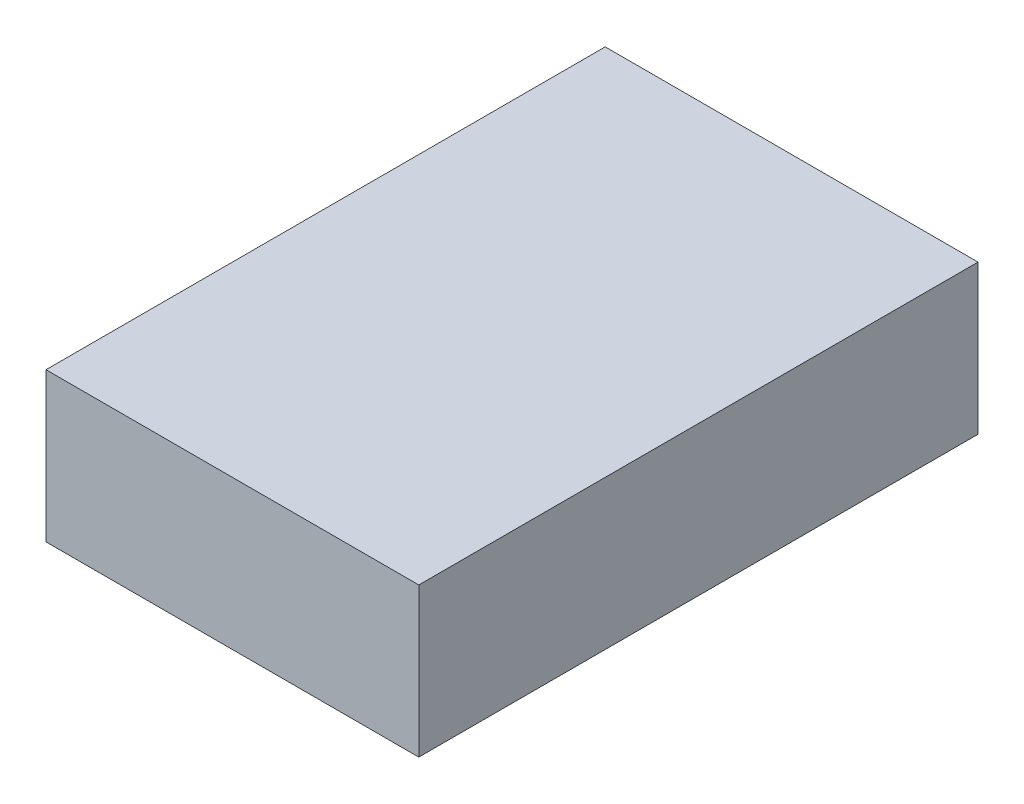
ISO-10303-21;
HEADER;
FILE_DESCRIPTION(('STEP AP214'),'2;1');
FILE_NAME('part.step','',(''),(''),'','','');
FILE_SCHEMA(('AUTOMOTIVE_DESIGN { 1 0 10303 214 1 1 1 1 }'));
ENDSEC;
DATA;
#1=APPLICATION_CONTEXT('core data for automotive mechanical design processes');
#2=APPLICATION_PROTOCOL_DEFINITION('international standard','automotive_design',2000,#1);
#3=PRODUCT_CONTEXT('',#1,'mechanical');
#4=PRODUCT('Part','Part','',(#3));
#5=PRODUCT_RELATED_PRODUCT_CATEGORY('part','',(#4));
#6=PRODUCT_DEFINITION_FORMATION('','',#4);
#7=PRODUCT_DEFINITION_CONTEXT('part definition',#1,'design');
#8=PRODUCT_DEFINITION('design','',#6,#7);
#9=PRODUCT_DEFINITION_SHAPE('','',#8);
#10=(LENGTH_UNIT() NAMED_UNIT(*) SI_UNIT(.MILLI.,.METRE.));
#11=(NAMED_UNIT(*) PLANE_ANGLE_UNIT() SI_UNIT($,.RADIAN.));
#12=(NAMED_UNIT(*) SI_UNIT($,.STERADIAN.) SOLID_ANGLE_UNIT());
#13=UNCERTAINTY_MEASURE_WITH_UNIT(LENGTH_MEASURE(1.E-05),#10,'distance_accuracy_value','');
#14=(GEOMETRIC_REPRESENTATION_CONTEXT(3) GLOBAL_UNCERTAINTY_ASSIGNED_CONTEXT((#13)) GLOBAL_UNIT_ASSIGNED_CONTEXT((#10,
#11,#12)) REPRESENTATION_CONTEXT('',''));
#15=CARTESIAN_POINT('',(0.,0.,0.));
#16=DIRECTION('',(0.,0.,1.));
#17=DIRECTION('',(1.,0.,0.));
#18=AXIS2_PLACEMENT_3D('',#15,#16,#17);
#19=CARTESIAN_POINT('',(10.,-4.,30.));
#20=DIRECTION('',(-1.,0.,0.));
#21=DIRECTION('',(0.,0.,1.));
#22=AXIS2_PLACEMENT_3D('',#19,#20,#21);
#23=PLANE('',#22);
#24=DIRECTION('',(0.,1.,0.));
#25=VECTOR('',#24,1.);
#26=CARTESIAN_POINT('',(10.,-4.,0.));
#27=LINE('',#26,#25);
#28=CARTESIAN_POINT('',(10.,-4.,0.));
#29=VERTEX_POINT('',#28);
#30=CARTESIAN_POINT('',(10.,4.,0.));
#31=VERTEX_POINT('',#30);
#32=EDGE_CURVE('E100',#29,#31,#27,.T.);
#33=ORIENTED_EDGE('',*,*,#32,.T.);
#34=DIRECTION('',(0.,0.,-1.));
#35=VECTOR('',#34,1.);
#36=CARTESIAN_POINT('',(10.,4.,30.));
#37=LINE('',#36,#35);
#38=CARTESIAN_POINT('',(10.,4.,30.));
#39=VERTEX_POINT('',#38);
#40=EDGE_CURVE('E11',#39,#31,#37,.T.);
#41=ORIENTED_EDGE('',*,*,#40,.F.);
#42=DIRECTION('',(0.,1.,0.));
#43=VECTOR('',#42,1.);
#44=CARTESIAN_POINT('',(10.,-4.,30.));
#45=LINE('',#44,#43);
#46=CARTESIAN_POINT('',(10.,-4.,30.));
#47=VERTEX_POINT('',#46);
#48=EDGE_CURVE('E88',#47,#39,#45,.T.);
#49=ORIENTED_EDGE('',*,*,#48,.F.);
#50=DIRECTION('',(0.,0.,-1.));
#51=VECTOR('',#50,1.);
#52=CARTESIAN_POINT('',(10.,-4.,30.));
#53=LINE('',#52,#51);
#54=EDGE_CURVE('E96',#47,#29,#53,.T.);
#55=ORIENTED_EDGE('',*,*,#54,.T.);
#56=EDGE_LOOP('',(#33,#41,#49,#55));
#57=FACE_BOUND('',#56,.T.);
#58=ADVANCED_FACE('F37',(#57),#23,.F.);
#59=CARTESIAN_POINT('',(-10.,4.,30.));
#60=DIRECTION('',(0.,-1.,0.));
#61=DIRECTION('',(0.,0.,-1.));
#62=AXIS2_PLACEMENT_3D('',#59,#60,#61);
#63=PLANE('',#62);
#64=DIRECTION('',(-1.,0.,0.));
#65=VECTOR('',#64,1.);
#66=CARTESIAN_POINT('',(-10.,4.,0.));
#67=LINE('',#66,#65);
#68=CARTESIAN_POINT('',(-10.,4.,0.));
#69=VERTEX_POINT('',#68);
#70=EDGE_CURVE('E92',#31,#69,#67,.T.);
#71=ORIENTED_EDGE('',*,*,#70,.T.);
#72=DIRECTION('',(0.,0.,-1.));
#73=VECTOR('',#72,1.);
#74=CARTESIAN_POINT('',(-10.,4.,30.));
#75=LINE('',#74,#73);
#76=CARTESIAN_POINT('',(-10.,4.,30.));
#77=VERTEX_POINT('',#76);
#78=EDGE_CURVE('E45',#77,#69,#75,.T.);
#79=ORIENTED_EDGE('',*,*,#78,.F.);
#80=DIRECTION('',(-1.,0.,0.));
#81=VECTOR('',#80,1.);
#82=CARTESIAN_POINT('',(-10.,4.,30.));
#83=LINE('',#82,#81);
#84=EDGE_CURVE('E83',#39,#77,#83,.T.);
#85=ORIENTED_EDGE('',*,*,#84,.F.);
#86=ORIENTED_EDGE('',*,*,#40,.T.);
#87=EDGE_LOOP('',(#71,#79,#85,#86));
#88=FACE_BOUND('',#87,.T.);
#89=ADVANCED_FACE('F91',(#88),#63,.F.);
#90=CARTESIAN_POINT('',(-10.,-4.,30.));
#91=DIRECTION('',(1.,0.,0.));
#92=DIRECTION('',(0.,0.,-1.));
#93=AXIS2_PLACEMENT_3D('',#90,#91,#92);
#94=PLANE('',#93);
#95=DIRECTION('',(0.,-1.,0.));
#96=VECTOR('',#95,1.);
#97=CARTESIAN_POINT('',(-10.,-4.,0.));
#98=LINE('',#97,#96);
#99=CARTESIAN_POINT('',(-10.,-4.,0.));
#100=VERTEX_POINT('',#99);
#101=EDGE_CURVE('E70',#69,#100,#98,.T.);
#102=ORIENTED_EDGE('',*,*,#101,.T.);
#103=DIRECTION('',(0.,0.,-1.));
#104=VECTOR('',#103,1.);
#105=CARTESIAN_POINT('',(-10.,-4.,30.));
#106=LINE('',#105,#104);
#107=CARTESIAN_POINT('',(-10.,-4.,30.));
#108=VERTEX_POINT('',#107);
#109=EDGE_CURVE('E93',#108,#100,#106,.T.);
#110=ORIENTED_EDGE('',*,*,#109,.F.);
#111=DIRECTION('',(0.,-1.,0.));
#112=VECTOR('',#111,1.);
#113=CARTESIAN_POINT('',(-10.,-4.,30.));
#114=LINE('',#113,#112);
#115=EDGE_CURVE('E86',#77,#108,#114,.T.);
#116=ORIENTED_EDGE('',*,*,#115,.F.);
#117=ORIENTED_EDGE('',*,*,#78,.T.);
#118=EDGE_LOOP('',(#102,#110,#116,#117));
#119=FACE_BOUND('',#118,.T.);
#120=ADVANCED_FACE('F94',(#119),#94,.F.);
#121=CARTESIAN_POINT('',(-10.,-4.,30.));
#122=DIRECTION('',(0.,1.,0.));
#123=DIRECTION('',(0.,0.,1.));
#124=AXIS2_PLACEMENT_3D('',#121,#122,#123);
#125=PLANE('',#124);
#126=DIRECTION('',(1.,0.,0.));
#127=VECTOR('',#126,1.);
#128=CARTESIAN_POINT('',(-10.,-4.,0.));
#129=LINE('',#128,#127);
#130=EDGE_CURVE('E76',#100,#29,#129,.T.);
#131=ORIENTED_EDGE('',*,*,#130,.T.);
#132=ORIENTED_EDGE('',*,*,#54,.F.);
#133=DIRECTION('',(1.,0.,0.));
#134=VECTOR('',#133,1.);
#135=CARTESIAN_POINT('',(-10.,-4.,30.));
#136=LINE('',#135,#134);
#137=EDGE_CURVE('E53',#108,#47,#136,.T.);
#138=ORIENTED_EDGE('',*,*,#137,.F.);
#139=ORIENTED_EDGE('',*,*,#109,.T.);
#140=EDGE_LOOP('',(#131,#132,#138,#139));
#141=FACE_BOUND('',#140,.T.);
#142=ADVANCED_FACE('F107',(#141),#125,.F.);
#143=CARTESIAN_POINT('',(0.,0.,30.));
#144=DIRECTION('',(0.,0.,-1.));
#145=DIRECTION('',(-1.,0.,0.));
#146=AXIS2_PLACEMENT_3D('',#143,#144,#145);
#147=PLANE('',#146);
#148=ORIENTED_EDGE('',*,*,#48,.T.);
#149=ORIENTED_EDGE('',*,*,#84,.T.);
#150=ORIENTED_EDGE('',*,*,#115,.T.);
#151=ORIENTED_EDGE('',*,*,#137,.T.);
#152=EDGE_LOOP('',(#148,#149,#150,#151));
#153=FACE_BOUND('',#152,.T.);
#154=ADVANCED_FACE('F84',(#153),#147,.F.);
#155=CARTESIAN_POINT('',(0.,0.,0.));
#156=DIRECTION('',(0.,0.,-1.));
#157=DIRECTION('',(-1.,0.,0.));
#158=AXIS2_PLACEMENT_3D('',#155,#156,#157);
#159=PLANE('',#158);
#160=ORIENTED_EDGE('',*,*,#32,.F.);
#161=ORIENTED_EDGE('',*,*,#130,.F.);
#162=ORIENTED_EDGE('',*,*,#101,.F.);
#163=ORIENTED_EDGE('',*,*,#70,.F.);
#164=EDGE_LOOP('',(#160,#161,#162,#163));
#165=FACE_BOUND('',#164,.T.);
#166=ADVANCED_FACE('F110',(#165),#159,.T.);
#167=CLOSED_SHELL('',(#58,#89,#120,#142,#154,#166));
#168=MANIFOLD_SOLID_BREP('B2',#167);
#169=ADVANCED_BREP_SHAPE_REPRESENTATION('',(#18,#168),#14);
#170=SHAPE_DEFINITION_REPRESENTATION(#9,#169);
ENDSEC;
END-ISO-10303-21;
